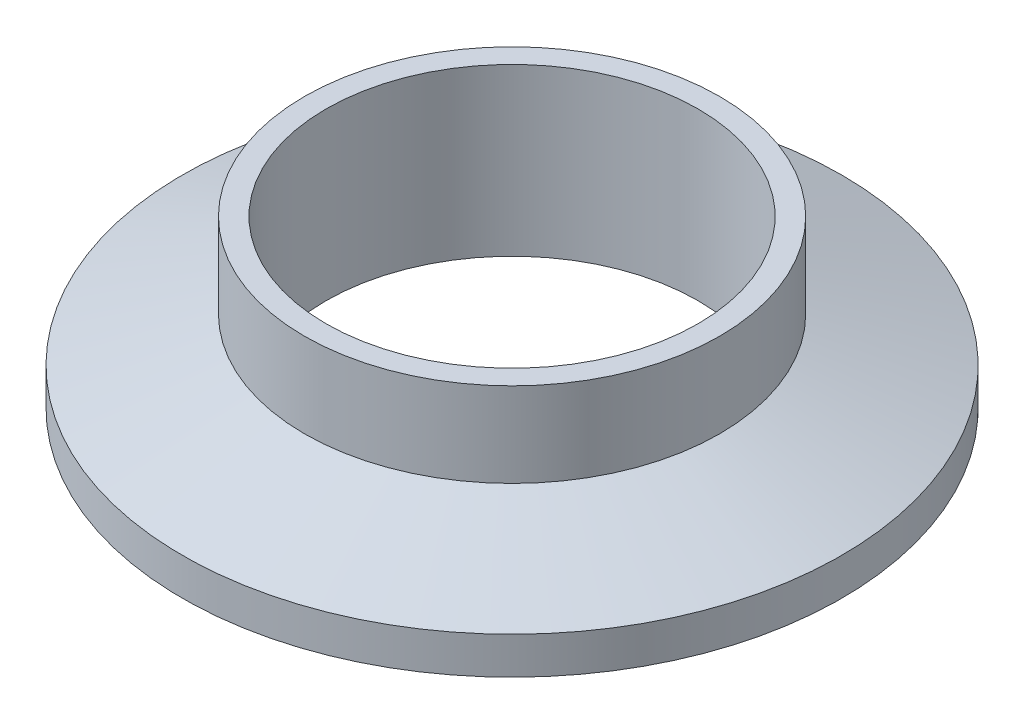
ISO-10303-21;
HEADER;
FILE_DESCRIPTION(('STEP AP214'),'2;1');
FILE_NAME('part.step','',(''),(''),'','','');
FILE_SCHEMA(('AUTOMOTIVE_DESIGN { 1 0 10303 214 1 1 1 1 }'));
ENDSEC;
DATA;
#1=APPLICATION_CONTEXT('core data for automotive mechanical design processes');
#2=APPLICATION_PROTOCOL_DEFINITION('international standard','automotive_design',2000,#1);
#3=PRODUCT_CONTEXT('',#1,'mechanical');
#4=PRODUCT('Part','Part','',(#3));
#5=PRODUCT_RELATED_PRODUCT_CATEGORY('part','',(#4));
#6=PRODUCT_DEFINITION_FORMATION('','',#4);
#7=PRODUCT_DEFINITION_CONTEXT('part definition',#1,'design');
#8=PRODUCT_DEFINITION('design','',#6,#7);
#9=PRODUCT_DEFINITION_SHAPE('','',#8);
#10=(LENGTH_UNIT() NAMED_UNIT(*) SI_UNIT(.MILLI.,.METRE.));
#11=(NAMED_UNIT(*) PLANE_ANGLE_UNIT() SI_UNIT($,.RADIAN.));
#12=(NAMED_UNIT(*) SI_UNIT($,.STERADIAN.) SOLID_ANGLE_UNIT());
#13=UNCERTAINTY_MEASURE_WITH_UNIT(LENGTH_MEASURE(1.E-05),#10,'distance_accuracy_value','');
#14=(GEOMETRIC_REPRESENTATION_CONTEXT(3) GLOBAL_UNCERTAINTY_ASSIGNED_CONTEXT((#13)) GLOBAL_UNIT_ASSIGNED_CONTEXT((#10,
#11,#12)) REPRESENTATION_CONTEXT('',''));
#15=CARTESIAN_POINT('',(0.,0.,0.));
#16=DIRECTION('',(0.,0.,1.));
#17=DIRECTION('',(1.,0.,0.));
#18=AXIS2_PLACEMENT_3D('',#15,#16,#17);
#19=CARTESIAN_POINT('',(0.,0.983998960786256,0.));
#20=DIRECTION('',(0.,1.,0.));
#21=DIRECTION('',(0.,0.,1.));
#22=AXIS2_PLACEMENT_3D('',#19,#20,#21);
#23=CONICAL_SURFACE('',#22,20.9336326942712,0.401425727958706);
#24=CARTESIAN_POINT('',(0.,0.46426288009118,0.));
#25=DIRECTION('',(0.,-1.,0.));
#26=DIRECTION('',(0.,0.,-1.));
#27=AXIS2_PLACEMENT_3D('',#24,#25,#26);
#28=CIRCLE('',#27,20.7130178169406);
#29=CARTESIAN_POINT('',(0.,0.46426288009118,-20.7130178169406));
#30=VERTEX_POINT('',#29);
#31=EDGE_CURVE('E12',#30,#30,#28,.T.);
#32=ORIENTED_EDGE('',*,*,#31,.F.);
#33=EDGE_LOOP('',(#32));
#34=FACE_BOUND('',#33,.T.);
#35=CARTESIAN_POINT('',(0.,0.983998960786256,0.));
#36=DIRECTION('',(0.,-1.,0.));
#37=DIRECTION('',(0.,0.,-1.));
#38=AXIS2_PLACEMENT_3D('',#35,#36,#37);
#39=CIRCLE('',#38,20.9336326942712);
#40=CARTESIAN_POINT('',(0.,0.983998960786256,-20.9336326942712));
#41=VERTEX_POINT('',#40);
#42=EDGE_CURVE('E81',#41,#41,#39,.T.);
#43=ORIENTED_EDGE('',*,*,#42,.T.);
#44=EDGE_LOOP('',(#43));
#45=FACE_BOUND('',#44,.T.);
#46=ADVANCED_FACE('F41',(#34,#45),#23,.T.);
#47=CARTESIAN_POINT('',(0.,0.761999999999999,0.));
#48=DIRECTION('',(0.,-1.,0.));
#49=DIRECTION('',(0.,0.,-1.));
#50=AXIS2_PLACEMENT_3D('',#47,#48,#49);
#51=TOROIDAL_SURFACE('',#50,20.0115931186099,0.761999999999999);
#52=CARTESIAN_POINT('',(0.,0.,0.));
#53=DIRECTION('',(0.,-1.,0.));
#54=DIRECTION('',(0.,0.,-1.));
#55=AXIS2_PLACEMENT_3D('',#52,#53,#54);
#56=CIRCLE('',#55,20.0115931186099);
#57=CARTESIAN_POINT('',(0.,0.,-20.0115931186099));
#58=VERTEX_POINT('',#57);
#59=EDGE_CURVE('E47',#58,#58,#56,.T.);
#60=ORIENTED_EDGE('',*,*,#59,.F.);
#61=EDGE_LOOP('',(#60));
#62=FACE_BOUND('',#61,.T.);
#63=ORIENTED_EDGE('',*,*,#31,.T.);
#64=EDGE_LOOP('',(#63));
#65=FACE_BOUND('',#64,.T.);
#66=ADVANCED_FACE('F110',(#62,#65),#51,.T.);
#67=CARTESIAN_POINT('',(0.,0.,0.));
#68=DIRECTION('',(0.,1.,0.));
#69=DIRECTION('',(0.,0.,1.));
#70=AXIS2_PLACEMENT_3D('',#67,#68,#69);
#71=PLANE('',#70);
#72=CARTESIAN_POINT('',(0.,0.,0.));
#73=DIRECTION('',(0.,-1.,0.));
#74=DIRECTION('',(0.,0.,-1.));
#75=AXIS2_PLACEMENT_3D('',#72,#73,#74);
#76=CIRCLE('',#75,14.224);
#77=CARTESIAN_POINT('',(0.,0.,-14.224));
#78=VERTEX_POINT('',#77);
#79=EDGE_CURVE('E51',#78,#78,#76,.T.);
#80=ORIENTED_EDGE('',*,*,#79,.F.);
#81=EDGE_LOOP('',(#80));
#82=FACE_BOUND('',#81,.T.);
#83=ORIENTED_EDGE('',*,*,#59,.T.);
#84=EDGE_LOOP('',(#83));
#85=FACE_BOUND('',#84,.T.);
#86=ADVANCED_FACE('F115',(#82,#85),#71,.F.);
#87=CARTESIAN_POINT('',(0.,0.,0.));
#88=DIRECTION('',(0.,-1.,0.));
#89=DIRECTION('',(0.,0.,-1.));
#90=AXIS2_PLACEMENT_3D('',#87,#88,#89);
#91=CYLINDRICAL_SURFACE('',#90,14.224);
#92=ORIENTED_EDGE('',*,*,#79,.T.);
#93=EDGE_LOOP('',(#92));
#94=FACE_BOUND('',#93,.T.);
#95=CARTESIAN_POINT('',(0.,12.7,0.));
#96=DIRECTION('',(0.,-1.,0.));
#97=DIRECTION('',(0.,0.,-1.));
#98=AXIS2_PLACEMENT_3D('',#95,#96,#97);
#99=CIRCLE('',#98,14.224);
#100=CARTESIAN_POINT('',(0.,12.7,-14.224));
#101=VERTEX_POINT('',#100);
#102=EDGE_CURVE('E55',#101,#101,#99,.T.);
#103=ORIENTED_EDGE('',*,*,#102,.F.);
#104=EDGE_LOOP('',(#103));
#105=FACE_BOUND('',#104,.T.);
#106=ADVANCED_FACE('F120',(#94,#105),#91,.F.);
#107=CARTESIAN_POINT('',(0.,12.7,0.));
#108=DIRECTION('',(0.,-1.,0.));
#109=DIRECTION('',(0.,0.,-1.));
#110=AXIS2_PLACEMENT_3D('',#107,#108,#109);
#111=PLANE('',#110);
#112=CARTESIAN_POINT('',(0.,12.7,0.));
#113=DIRECTION('',(0.,-1.,0.));
#114=DIRECTION('',(0.,0.,-1.));
#115=AXIS2_PLACEMENT_3D('',#112,#113,#114);
#116=CIRCLE('',#115,15.875);
#117=CARTESIAN_POINT('',(0.,12.7,-15.875));
#118=VERTEX_POINT('',#117);
#119=EDGE_CURVE('E60',#118,#118,#116,.T.);
#120=ORIENTED_EDGE('',*,*,#119,.F.);
#121=EDGE_LOOP('',(#120));
#122=FACE_BOUND('',#121,.T.);
#123=ORIENTED_EDGE('',*,*,#102,.T.);
#124=EDGE_LOOP('',(#123));
#125=FACE_BOUND('',#124,.T.);
#126=ADVANCED_FACE('F126',(#122,#125),#111,.F.);
#127=CARTESIAN_POINT('',(0.,0.,0.));
#128=DIRECTION('',(0.,-1.,0.));
#129=DIRECTION('',(0.,0.,-1.));
#130=AXIS2_PLACEMENT_3D('',#127,#128,#129);
#131=CYLINDRICAL_SURFACE('',#130,15.875);
#132=CARTESIAN_POINT('',(0.,6.23765772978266,0.));
#133=DIRECTION('',(0.,-1.,0.));
#134=DIRECTION('',(0.,0.,-1.));
#135=AXIS2_PLACEMENT_3D('',#132,#133,#134);
#136=CIRCLE('',#135,15.875);
#137=CARTESIAN_POINT('',(0.,6.23765772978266,-15.875));
#138=VERTEX_POINT('',#137);
#139=EDGE_CURVE('E63',#138,#138,#136,.T.);
#140=ORIENTED_EDGE('',*,*,#139,.F.);
#141=EDGE_LOOP('',(#140));
#142=FACE_BOUND('',#141,.T.);
#143=ORIENTED_EDGE('',*,*,#119,.T.);
#144=EDGE_LOOP('',(#143));
#145=FACE_BOUND('',#144,.T.);
#146=ADVANCED_FACE('F130',(#142,#145),#131,.T.);
#147=CARTESIAN_POINT('',(0.,6.23765772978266,0.));
#148=DIRECTION('',(0.,-1.,0.));
#149=DIRECTION('',(0.,0.,-1.));
#150=AXIS2_PLACEMENT_3D('',#147,#148,#149);
#151=CONICAL_SURFACE('',#150,15.875,1.22173047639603);
#152=CARTESIAN_POINT('',(0.,2.8448,0.));
#153=DIRECTION('',(0.,-1.,0.));
#154=DIRECTION('',(0.,0.,-1.));
#155=AXIS2_PLACEMENT_3D('',#152,#153,#154);
#156=CIRCLE('',#155,25.1968);
#157=CARTESIAN_POINT('',(0.,2.8448,-25.1968));
#158=VERTEX_POINT('',#157);
#159=EDGE_CURVE('E66',#158,#158,#156,.T.);
#160=ORIENTED_EDGE('',*,*,#159,.F.);
#161=EDGE_LOOP('',(#160));
#162=FACE_BOUND('',#161,.T.);
#163=ORIENTED_EDGE('',*,*,#139,.T.);
#164=EDGE_LOOP('',(#163));
#165=FACE_BOUND('',#164,.T.);
#166=ADVANCED_FACE('F134',(#162,#165),#151,.T.);
#167=CARTESIAN_POINT('',(0.,0.,0.));
#168=DIRECTION('',(0.,-1.,0.));
#169=DIRECTION('',(0.,0.,-1.));
#170=AXIS2_PLACEMENT_3D('',#167,#168,#169);
#171=CYLINDRICAL_SURFACE('',#170,25.1968);
#172=CARTESIAN_POINT('',(0.,0.,0.));
#173=DIRECTION('',(0.,-1.,0.));
#174=DIRECTION('',(0.,0.,-1.));
#175=AXIS2_PLACEMENT_3D('',#172,#173,#174);
#176=CIRCLE('',#175,25.1968);
#177=CARTESIAN_POINT('',(0.,0.,-25.1968));
#178=VERTEX_POINT('',#177);
#179=EDGE_CURVE('E69',#178,#178,#176,.T.);
#180=ORIENTED_EDGE('',*,*,#179,.F.);
#181=EDGE_LOOP('',(#180));
#182=FACE_BOUND('',#181,.T.);
#183=ORIENTED_EDGE('',*,*,#159,.T.);
#184=EDGE_LOOP('',(#183));
#185=FACE_BOUND('',#184,.T.);
#186=ADVANCED_FACE('F106',(#182,#185),#171,.T.);
#187=CARTESIAN_POINT('',(0.,0.,0.));
#188=DIRECTION('',(0.,1.,0.));
#189=DIRECTION('',(0.,0.,1.));
#190=AXIS2_PLACEMENT_3D('',#187,#188,#189);
#191=PLANE('',#190);
#192=CARTESIAN_POINT('',(0.,0.,0.));
#193=DIRECTION('',(0.,-1.,0.));
#194=DIRECTION('',(0.,0.,-1.));
#195=AXIS2_PLACEMENT_3D('',#192,#193,#194);
#196=CIRCLE('',#195,23.9521599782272);
#197=CARTESIAN_POINT('',(0.,0.,-23.9521599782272));
#198=VERTEX_POINT('',#197);
#199=EDGE_CURVE('E72',#198,#198,#196,.T.);
#200=ORIENTED_EDGE('',*,*,#199,.F.);
#201=EDGE_LOOP('',(#200));
#202=FACE_BOUND('',#201,.T.);
#203=ORIENTED_EDGE('',*,*,#179,.T.);
#204=EDGE_LOOP('',(#203));
#205=FACE_BOUND('',#204,.T.);
#206=ADVANCED_FACE('F100',(#202,#205),#191,.F.);
#207=CARTESIAN_POINT('',(0.,0.761999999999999,0.));
#208=DIRECTION('',(0.,-1.,0.));
#209=DIRECTION('',(0.,0.,-1.));
#210=AXIS2_PLACEMENT_3D('',#207,#208,#209);
#211=TOROIDAL_SURFACE('',#210,23.9521599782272,0.761999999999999);
#212=ORIENTED_EDGE('',*,*,#199,.T.);
#213=EDGE_LOOP('',(#212));
#214=FACE_BOUND('',#213,.T.);
#215=CARTESIAN_POINT('',(0.,0.464262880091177,0.));
#216=DIRECTION('',(0.,-1.,0.));
#217=DIRECTION('',(0.,0.,-1.));
#218=AXIS2_PLACEMENT_3D('',#215,#216,#217);
#219=CIRCLE('',#218,23.2507352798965);
#220=CARTESIAN_POINT('',(0.,0.464262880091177,-23.2507352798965));
#221=VERTEX_POINT('',#220);
#222=EDGE_CURVE('E75',#221,#221,#219,.T.);
#223=ORIENTED_EDGE('',*,*,#222,.F.);
#224=EDGE_LOOP('',(#223));
#225=FACE_BOUND('',#224,.T.);
#226=ADVANCED_FACE('F95',(#214,#225),#211,.T.);
#227=CARTESIAN_POINT('',(0.,0.464262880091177,0.));
#228=DIRECTION('',(0.,-1.,0.));
#229=DIRECTION('',(0.,0.,-1.));
#230=AXIS2_PLACEMENT_3D('',#227,#228,#229);
#231=CONICAL_SURFACE('',#230,23.2507352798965,0.401425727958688);
#232=CARTESIAN_POINT('',(0.,0.872854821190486,0.));
#233=DIRECTION('',(0.,-1.,0.));
#234=DIRECTION('',(0.,0.,-1.));
#235=AXIS2_PLACEMENT_3D('',#232,#233,#234);
#236=CIRCLE('',#235,23.0772982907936);
#237=CARTESIAN_POINT('',(0.,0.872854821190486,-23.0772982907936));
#238=VERTEX_POINT('',#237);
#239=EDGE_CURVE('E78',#238,#238,#236,.T.);
#240=ORIENTED_EDGE('',*,*,#239,.F.);
#241=EDGE_LOOP('',(#240));
#242=FACE_BOUND('',#241,.T.);
#243=ORIENTED_EDGE('',*,*,#222,.T.);
#244=EDGE_LOOP('',(#243));
#245=FACE_BOUND('',#244,.T.);
#246=ADVANCED_FACE('F89',(#242,#245),#231,.F.);
#247=CARTESIAN_POINT('',(0.,0.406400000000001,0.));
#248=DIRECTION('',(0.,-1.,0.));
#249=DIRECTION('',(0.,0.,-1.));
#250=AXIS2_PLACEMENT_3D('',#247,#248,#249);
#251=TOROIDAL_SURFACE('',#250,21.9783995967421,1.1938);
#252=ORIENTED_EDGE('',*,*,#42,.F.);
#253=EDGE_LOOP('',(#252));
#254=FACE_BOUND('',#253,.T.);
#255=ORIENTED_EDGE('',*,*,#239,.T.);
#256=EDGE_LOOP('',(#255));
#257=FACE_BOUND('',#256,.T.);
#258=ADVANCED_FACE('F86',(#254,#257),#251,.F.);
#259=CLOSED_SHELL('',(#46,#66,#86,#106,#126,#146,#166,#186,#206,#226,#246,#258));
#260=MANIFOLD_SOLID_BREP('B2',#259);
#261=ADVANCED_BREP_SHAPE_REPRESENTATION('',(#18,#260),#14);
#262=SHAPE_DEFINITION_REPRESENTATION(#9,#261);
ENDSEC;
END-ISO-10303-21;
